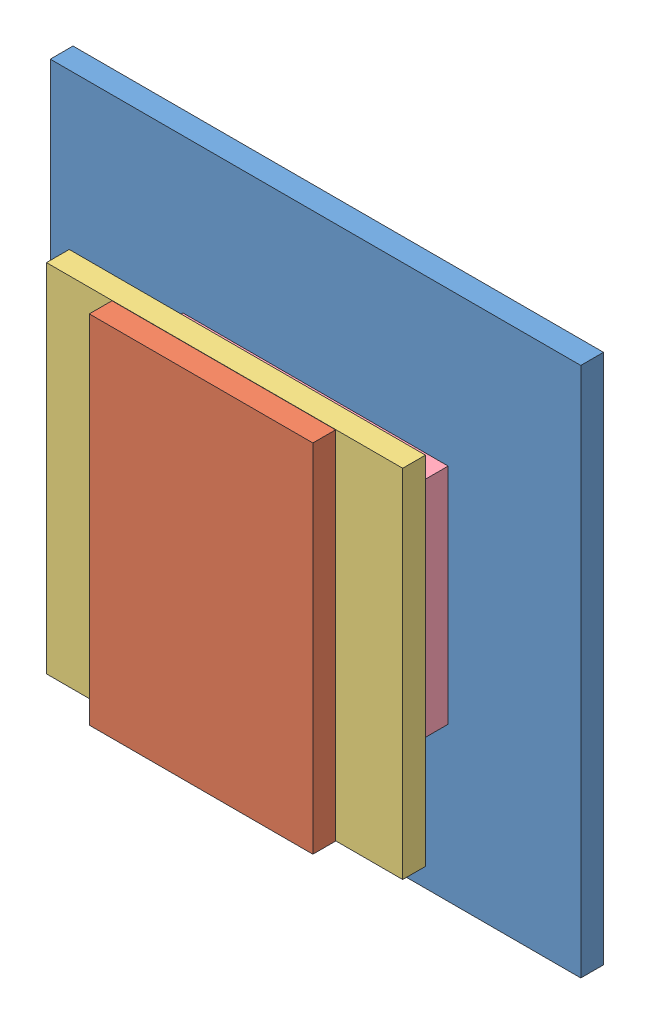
SolidWorks assembly buzzer_dessus.SLDASM, configuration Défaut (file format 14000). Lengths in mm.
Overall size (70 70 18).
4 component instances, 4 part files, 6 mates.
Components (placement in the parent):
- dessus0-1: dessus0.SLDPRT [Défaut] at (-0.3178 -3.4958 68.5) size (70 70 3)
- dessus1-1: dessus1.SLDPRT [Défaut] at (-0.4188 -3.5313 83.5) size (29.5 47 3)
- dessus2-1: dessus2.SLDPRT [Défaut] at (-0.3178 -3.4958 80.5) size (47 47 3)
- dessus3-1: dessus3.SLDPRT [Défaut] at (-0.3178 -3.4958 71.5) x (0 -1 0) z (0 0 1) size (29.5 35 3)
Mates (geometry in assembly coordinates):
- Coïncidente1: coincident anti-aligned: plane of dessus0-1 through (-0.3178 -3.4958 71.5) normal (0 0 1); plane of dessus3-1 through (-0.3178 -3.4958 71.5) normal (0 0 -1)
- Parallèle1: parallel aligned: plane of dessus0-1 through (-35.3178 -38.4958 71.5) normal (0 -1 0); plane of dessus3-1 through (17.1822 -18.2458 74.5) normal (0 -1 0)
- Distance1: distance = 20.25 mm aligned: plane of dessus3-1 through (17.1822 -18.2458 74.5) normal (0 -1 0); plane of dessus0-1 through (-35.3178 -38.4958 71.5) normal (0 -1 0)
- Distance2: distance = 17.5 mm aligned: plane of dessus3-1 through (17.1822 11.2542 74.5) normal (1 0 0); plane of dessus0-1 through (34.6822 31.5042 71.5) normal (1 0 0)
- Distance4: distance = 11.5 mm aligned: plane of dessus0-1 through (-35.3178 31.5042 71.5) normal (-1 0 0); plane of dessus2-1 through (-23.8178 20.0042 83.5) normal (-1 0 0)
- Coïncidente7: coincident anti-aligned: plane of dessus1-1 through (-0.4188 -3.5313 83.5) normal (0 0 -1); plane of dessus2-1 through (-0.3178 -3.4958 83.5) normal (0 0 1)
